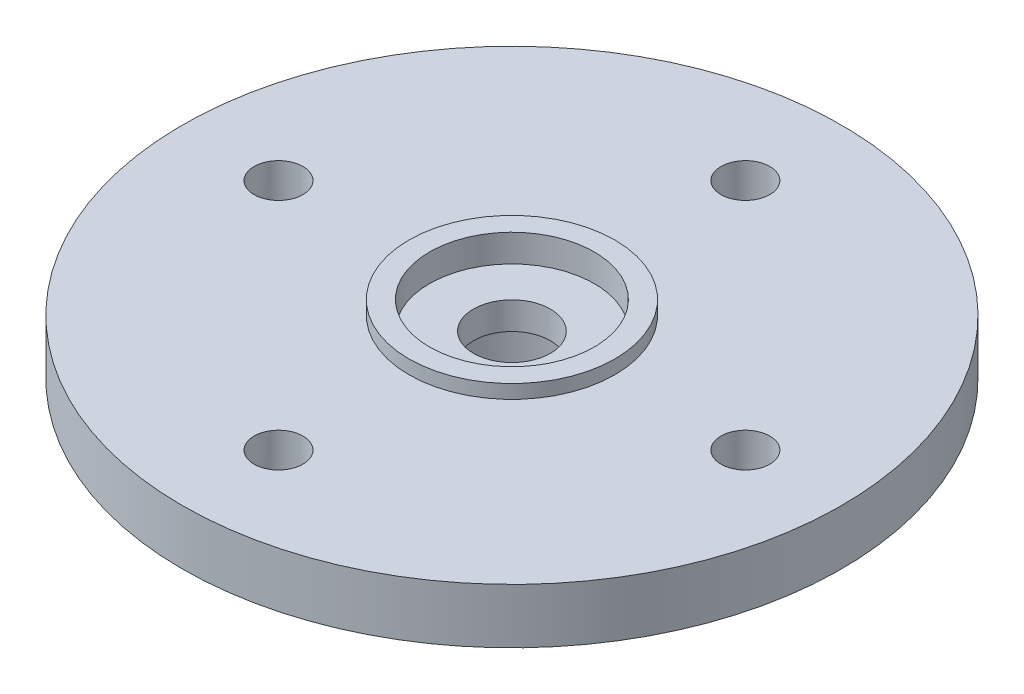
from build123d import *

# Parameters (mm, degrees)
F_2_56_TAPPED_HOLE1_D = 1.778
SKETCH4_R             = 3
CUT_EXTRUDE1_DEPTH    = 1
CUT_EXTRUDE2_START    = -3
SKETCH5_R             = 3
CUT_EXTRUDE2_DEPTH    = 3


with BuildPart() as part:
    # Sketch1 → Revolve1 (revolve)
    with BuildSketch(Plane.XY, mode=Mode.PRIVATE) as revolve1_sk:
        Polygon((-12, 0), (-3.75, 0), (-3.75, 0.5), (-1.4, 0.5), (-1.4, -4.5), (-4.5, -4.5), (-4.5, -2), (-12, -2), align=None)
    revolve(revolve1_sk.sketch.rotate(Axis((0, 0, 0), (0, -1, 0)), 270), axis=Axis((0, 0, 0), (0, -1, 0)))

    # 2-56 Tapped Hole1 (through all)
    with Locations(Plane(origin=(0, 0, 0), x_dir=(-1, 0, 0), z_dir=(0, 1, 0))):
        with Locations((0, -8.5), (8.5, 0), (-8.5, 0), (0, 8.5)):
            Hole(F_2_56_TAPPED_HOLE1_D / 2)

    # Sketch4 → Cut-Extrude1 (cut)
    with BuildSketch(Plane(origin=(0, 0.5, 0), x_dir=(-1, 0, 0), z_dir=(0, 1, 0))):
        with Locations(Location((0, 0, 0), (0, 0, 90))):
            Circle(SKETCH4_R)
    extrude(amount=-CUT_EXTRUDE1_DEPTH, mode=Mode.SUBTRACT)

    # Sketch5 → Cut-Extrude2 (cut)
    with BuildSketch(Plane.XZ.offset(4.5).offset(CUT_EXTRUDE2_START)):
        with Locations(Location((0, 0, 0), (0, 0, 90))):
            Circle(SKETCH5_R)
    extrude(amount=CUT_EXTRUDE2_DEPTH, mode=Mode.SUBTRACT)


solid = part.part
